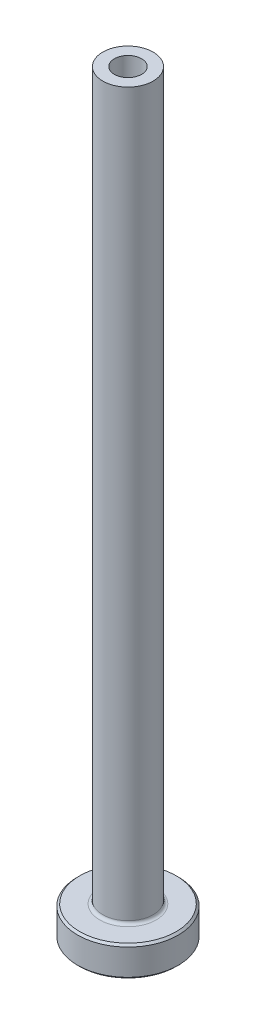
ISO-10303-21;
HEADER;
FILE_DESCRIPTION(('STEP AP214'),'2;1');
FILE_NAME('part.step','',(''),(''),'','','');
FILE_SCHEMA(('AUTOMOTIVE_DESIGN { 1 0 10303 214 1 1 1 1 }'));
ENDSEC;
DATA;
#1=APPLICATION_CONTEXT('core data for automotive mechanical design processes');
#2=APPLICATION_PROTOCOL_DEFINITION('international standard','automotive_design',2000,#1);
#3=PRODUCT_CONTEXT('',#1,'mechanical');
#4=PRODUCT('Part','Part','',(#3));
#5=PRODUCT_RELATED_PRODUCT_CATEGORY('part','',(#4));
#6=PRODUCT_DEFINITION_FORMATION('','',#4);
#7=PRODUCT_DEFINITION_CONTEXT('part definition',#1,'design');
#8=PRODUCT_DEFINITION('design','',#6,#7);
#9=PRODUCT_DEFINITION_SHAPE('','',#8);
#10=(LENGTH_UNIT() NAMED_UNIT(*) SI_UNIT(.MILLI.,.METRE.));
#11=(NAMED_UNIT(*) PLANE_ANGLE_UNIT() SI_UNIT($,.RADIAN.));
#12=(NAMED_UNIT(*) SI_UNIT($,.STERADIAN.) SOLID_ANGLE_UNIT());
#13=UNCERTAINTY_MEASURE_WITH_UNIT(LENGTH_MEASURE(1.E-05),#10,'distance_accuracy_value','');
#14=(GEOMETRIC_REPRESENTATION_CONTEXT(3) GLOBAL_UNCERTAINTY_ASSIGNED_CONTEXT((#13)) GLOBAL_UNIT_ASSIGNED_CONTEXT((#10,
#11,#12)) REPRESENTATION_CONTEXT('',''));
#15=CARTESIAN_POINT('',(0.,0.,0.));
#16=DIRECTION('',(0.,0.,1.));
#17=DIRECTION('',(1.,0.,0.));
#18=AXIS2_PLACEMENT_3D('',#15,#16,#17);
#19=CARTESIAN_POINT('',(0.,92.1876809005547,0.));
#20=DIRECTION('',(0.,1.,0.));
#21=DIRECTION('',(0.,0.,1.));
#22=AXIS2_PLACEMENT_3D('',#19,#20,#21);
#23=CYLINDRICAL_SURFACE('',#22,1.35000000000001);
#24=CARTESIAN_POINT('',(0.,75.,0.));
#25=DIRECTION('',(0.,1.,0.));
#26=DIRECTION('',(0.,0.,1.));
#27=AXIS2_PLACEMENT_3D('',#24,#25,#26);
#28=CIRCLE('',#27,1.35000000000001);
#29=CARTESIAN_POINT('',(0.,75.,1.35000000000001));
#30=VERTEX_POINT('',#29);
#31=EDGE_CURVE('E62',#30,#30,#28,.T.);
#32=ORIENTED_EDGE('',*,*,#31,.T.);
#33=EDGE_LOOP('',(#32));
#34=FACE_BOUND('',#33,.T.);
#35=CARTESIAN_POINT('',(0.,30.,0.));
#36=DIRECTION('',(0.,1.,0.));
#37=DIRECTION('',(0.,0.,1.));
#38=AXIS2_PLACEMENT_3D('',#35,#36,#37);
#39=CIRCLE('',#38,1.35000000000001);
#40=CARTESIAN_POINT('',(0.,30.,1.35000000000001));
#41=VERTEX_POINT('',#40);
#42=EDGE_CURVE('E71',#41,#41,#39,.T.);
#43=ORIENTED_EDGE('',*,*,#42,.F.);
#44=EDGE_LOOP('',(#43));
#45=FACE_BOUND('',#44,.T.);
#46=ADVANCED_FACE('F30',(#34,#45),#23,.F.);
#47=CARTESIAN_POINT('',(-1.35000000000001,75.,0.));
#48=DIRECTION('',(0.,1.,0.));
#49=DIRECTION('',(0.,0.,1.));
#50=AXIS2_PLACEMENT_3D('',#47,#48,#49);
#51=PLANE('',#50);
#52=CARTESIAN_POINT('',(0.,75.,0.));
#53=DIRECTION('',(0.,1.,0.));
#54=DIRECTION('',(0.,0.,1.));
#55=AXIS2_PLACEMENT_3D('',#52,#53,#54);
#56=CIRCLE('',#55,2.5);
#57=CARTESIAN_POINT('',(0.,75.,2.5));
#58=VERTEX_POINT('',#57);
#59=EDGE_CURVE('E65',#58,#58,#56,.T.);
#60=ORIENTED_EDGE('',*,*,#59,.T.);
#61=EDGE_LOOP('',(#60));
#62=FACE_BOUND('',#61,.T.);
#63=ORIENTED_EDGE('',*,*,#31,.F.);
#64=EDGE_LOOP('',(#63));
#65=FACE_BOUND('',#64,.T.);
#66=ADVANCED_FACE('F79',(#62,#65),#51,.T.);
#67=CARTESIAN_POINT('',(0.,92.1876809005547,0.));
#68=DIRECTION('',(0.,1.,0.));
#69=DIRECTION('',(0.,0.,1.));
#70=AXIS2_PLACEMENT_3D('',#67,#68,#69);
#71=CYLINDRICAL_SURFACE('',#70,2.49999999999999);
#72=CARTESIAN_POINT('',(0.,3.3,0.));
#73=DIRECTION('',(0.,1.,0.));
#74=DIRECTION('',(0.,0.,1.));
#75=AXIS2_PLACEMENT_3D('',#72,#73,#74);
#76=CIRCLE('',#75,2.49999999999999);
#77=CARTESIAN_POINT('',(0.,3.3,2.49999999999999));
#78=VERTEX_POINT('',#77);
#79=EDGE_CURVE('E59',#78,#78,#76,.T.);
#80=ORIENTED_EDGE('',*,*,#79,.T.);
#81=EDGE_LOOP('',(#80));
#82=FACE_BOUND('',#81,.T.);
#83=ORIENTED_EDGE('',*,*,#59,.F.);
#84=EDGE_LOOP('',(#83));
#85=FACE_BOUND('',#84,.T.);
#86=ADVANCED_FACE('F85',(#82,#85),#71,.T.);
#87=CARTESIAN_POINT('',(-2.49999999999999,3.,0.));
#88=DIRECTION('',(0.,1.,0.));
#89=DIRECTION('',(0.,0.,1.));
#90=AXIS2_PLACEMENT_3D('',#87,#88,#89);
#91=PLANE('',#90);
#92=CARTESIAN_POINT('',(0.,3.,0.));
#93=DIRECTION('',(0.,1.,0.));
#94=DIRECTION('',(0.,0.,1.));
#95=AXIS2_PLACEMENT_3D('',#92,#93,#94);
#96=CIRCLE('',#95,4.79999999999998);
#97=CARTESIAN_POINT('',(0.,3.,4.79999999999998));
#98=VERTEX_POINT('',#97);
#99=EDGE_CURVE('E53',#98,#98,#96,.T.);
#100=ORIENTED_EDGE('',*,*,#99,.T.);
#101=EDGE_LOOP('',(#100));
#102=FACE_BOUND('',#101,.T.);
#103=CARTESIAN_POINT('',(0.,3.,0.));
#104=DIRECTION('',(0.,1.,0.));
#105=DIRECTION('',(0.,0.,1.));
#106=AXIS2_PLACEMENT_3D('',#103,#104,#105);
#107=CIRCLE('',#106,2.79999999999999);
#108=CARTESIAN_POINT('',(0.,3.,2.79999999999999));
#109=VERTEX_POINT('',#108);
#110=EDGE_CURVE('E56',#109,#109,#107,.F.);
#111=ORIENTED_EDGE('',*,*,#110,.T.);
#112=EDGE_LOOP('',(#111));
#113=FACE_BOUND('',#112,.T.);
#114=ADVANCED_FACE('F111',(#102,#113),#91,.T.);
#115=CARTESIAN_POINT('',(0.,92.1876809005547,0.));
#116=DIRECTION('',(0.,1.,0.));
#117=DIRECTION('',(0.,0.,1.));
#118=AXIS2_PLACEMENT_3D('',#115,#116,#117);
#119=CYLINDRICAL_SURFACE('',#118,4.99999999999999);
#120=CARTESIAN_POINT('',(0.,2.79999999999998,0.));
#121=DIRECTION('',(0.,1.,0.));
#122=DIRECTION('',(0.,0.,1.));
#123=AXIS2_PLACEMENT_3D('',#120,#121,#122);
#124=CIRCLE('',#123,4.99999999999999);
#125=CARTESIAN_POINT('',(0.,2.79999999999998,4.99999999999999));
#126=VERTEX_POINT('',#125);
#127=EDGE_CURVE('E45',#126,#126,#124,.F.);
#128=ORIENTED_EDGE('',*,*,#127,.T.);
#129=EDGE_LOOP('',(#128));
#130=FACE_BOUND('',#129,.T.);
#131=CARTESIAN_POINT('',(0.,0.199999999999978,0.));
#132=DIRECTION('',(0.,-1.,0.));
#133=DIRECTION('',(0.,0.,-1.));
#134=AXIS2_PLACEMENT_3D('',#131,#132,#133);
#135=CIRCLE('',#134,4.99999999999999);
#136=CARTESIAN_POINT('',(0.,0.199999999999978,4.99999999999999));
#137=VERTEX_POINT('',#136);
#138=EDGE_CURVE('E50',#137,#137,#135,.F.);
#139=ORIENTED_EDGE('',*,*,#138,.T.);
#140=EDGE_LOOP('',(#139));
#141=FACE_BOUND('',#140,.T.);
#142=ADVANCED_FACE('F108',(#130,#141),#119,.T.);
#143=CARTESIAN_POINT('',(-4.99999999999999,0.,0.));
#144=DIRECTION('',(0.,-1.,0.));
#145=DIRECTION('',(0.,0.,-1.));
#146=AXIS2_PLACEMENT_3D('',#143,#144,#145);
#147=PLANE('',#146);
#148=CARTESIAN_POINT('',(0.,0.,0.));
#149=DIRECTION('',(0.,-1.,0.));
#150=DIRECTION('',(0.,0.,-1.));
#151=AXIS2_PLACEMENT_3D('',#148,#149,#150);
#152=CIRCLE('',#151,2.09999999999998);
#153=CARTESIAN_POINT('',(0.,0.,-2.09999999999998));
#154=VERTEX_POINT('',#153);
#155=EDGE_CURVE('E37',#154,#154,#152,.F.);
#156=ORIENTED_EDGE('',*,*,#155,.T.);
#157=EDGE_LOOP('',(#156));
#158=FACE_BOUND('',#157,.T.);
#159=CARTESIAN_POINT('',(0.,0.,0.));
#160=DIRECTION('',(0.,-1.,0.));
#161=DIRECTION('',(0.,0.,-1.));
#162=AXIS2_PLACEMENT_3D('',#159,#160,#161);
#163=CIRCLE('',#162,4.80000000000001);
#164=CARTESIAN_POINT('',(0.,0.,4.80000000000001));
#165=VERTEX_POINT('',#164);
#166=EDGE_CURVE('E41',#165,#165,#163,.T.);
#167=ORIENTED_EDGE('',*,*,#166,.T.);
#168=EDGE_LOOP('',(#167));
#169=FACE_BOUND('',#168,.T.);
#170=ADVANCED_FACE('F110',(#158,#169),#147,.T.);
#171=CARTESIAN_POINT('',(0.,92.1876809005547,0.));
#172=DIRECTION('',(0.,1.,0.));
#173=DIRECTION('',(0.,0.,1.));
#174=AXIS2_PLACEMENT_3D('',#171,#172,#173);
#175=CYLINDRICAL_SURFACE('',#174,1.59999999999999);
#176=CARTESIAN_POINT('',(0.,0.5,0.));
#177=DIRECTION('',(0.,-1.,0.));
#178=DIRECTION('',(0.,0.,-1.));
#179=AXIS2_PLACEMENT_3D('',#176,#177,#178);
#180=CIRCLE('',#179,1.59999999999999);
#181=CARTESIAN_POINT('',(0.,0.5,-1.59999999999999));
#182=VERTEX_POINT('',#181);
#183=EDGE_CURVE('E10',#182,#182,#180,.T.);
#184=ORIENTED_EDGE('',*,*,#183,.T.);
#185=EDGE_LOOP('',(#184));
#186=FACE_BOUND('',#185,.T.);
#187=CARTESIAN_POINT('',(0.,18.,0.));
#188=DIRECTION('',(0.,1.,0.));
#189=DIRECTION('',(0.,0.,1.));
#190=AXIS2_PLACEMENT_3D('',#187,#188,#189);
#191=CIRCLE('',#190,1.59999999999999);
#192=CARTESIAN_POINT('',(0.,18.,1.59999999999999));
#193=VERTEX_POINT('',#192);
#194=EDGE_CURVE('E68',#193,#193,#191,.T.);
#195=ORIENTED_EDGE('',*,*,#194,.T.);
#196=EDGE_LOOP('',(#195));
#197=FACE_BOUND('',#196,.T.);
#198=ADVANCED_FACE('F118',(#186,#197),#175,.F.);
#199=CARTESIAN_POINT('',(0.,18.,0.));
#200=DIRECTION('',(0.,-1.,0.));
#201=DIRECTION('',(0.,0.,-1.));
#202=AXIS2_PLACEMENT_3D('',#199,#200,#201);
#203=CONICAL_SURFACE('',#202,1.59999999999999,0.0208303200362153);
#204=ORIENTED_EDGE('',*,*,#42,.T.);
#205=EDGE_LOOP('',(#204));
#206=FACE_BOUND('',#205,.T.);
#207=ORIENTED_EDGE('',*,*,#194,.F.);
#208=EDGE_LOOP('',(#207));
#209=FACE_BOUND('',#208,.T.);
#210=ADVANCED_FACE('F75',(#206,#209),#203,.F.);
#211=CARTESIAN_POINT('',(0.,3.3,0.));
#212=DIRECTION('',(0.,1.,0.));
#213=DIRECTION('',(0.,0.,1.));
#214=AXIS2_PLACEMENT_3D('',#211,#212,#213);
#215=TOROIDAL_SURFACE('',#214,2.79999999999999,0.3);
#216=ORIENTED_EDGE('',*,*,#110,.F.);
#217=EDGE_LOOP('',(#216));
#218=FACE_BOUND('',#217,.T.);
#219=ORIENTED_EDGE('',*,*,#79,.F.);
#220=EDGE_LOOP('',(#219));
#221=FACE_BOUND('',#220,.T.);
#222=ADVANCED_FACE('F90',(#218,#221),#215,.F.);
#223=CARTESIAN_POINT('',(0.,3.,0.));
#224=DIRECTION('',(0.,-1.,0.));
#225=DIRECTION('',(0.,0.,-1.));
#226=AXIS2_PLACEMENT_3D('',#223,#224,#225);
#227=CONICAL_SURFACE('',#226,4.79999999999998,0.785398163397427);
#228=ORIENTED_EDGE('',*,*,#127,.F.);
#229=EDGE_LOOP('',(#228));
#230=FACE_BOUND('',#229,.T.);
#231=ORIENTED_EDGE('',*,*,#99,.F.);
#232=EDGE_LOOP('',(#231));
#233=FACE_BOUND('',#232,.T.);
#234=ADVANCED_FACE('F93',(#230,#233),#227,.T.);
#235=CARTESIAN_POINT('',(0.,0.199999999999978,0.));
#236=DIRECTION('',(0.,1.,0.));
#237=DIRECTION('',(0.,0.,1.));
#238=AXIS2_PLACEMENT_3D('',#235,#236,#237);
#239=CONICAL_SURFACE('',#238,4.99999999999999,0.785398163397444);
#240=CARTESIAN_POINT('',(0.,0.,4.80000000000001));
#241=CARTESIAN_POINT('',(0.,0.00208333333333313,4.80208333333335));
#242=CARTESIAN_POINT('',(0.,0.00416666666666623,4.80416666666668));
#243=CARTESIAN_POINT('',(0.,0.00833333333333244,4.80833333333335));
#244=CARTESIAN_POINT('',(0.,0.0104166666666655,4.81041666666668));
#245=CARTESIAN_POINT('',(0.,0.0145833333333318,4.81458333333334));
#246=CARTESIAN_POINT('',(0.,0.0166666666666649,4.81666666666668));
#247=CARTESIAN_POINT('',(0.,0.0208333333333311,4.82083333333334));
#248=CARTESIAN_POINT('',(0.,0.0229166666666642,4.82291666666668));
#249=CARTESIAN_POINT('',(0.,0.0270833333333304,4.82708333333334));
#250=CARTESIAN_POINT('',(0.,0.0291666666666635,4.82916666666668));
#251=CARTESIAN_POINT('',(0.,0.0333333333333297,4.83333333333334));
#252=CARTESIAN_POINT('',(0.,0.0354166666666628,4.83541666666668));
#253=CARTESIAN_POINT('',(0.,0.039583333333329,4.83958333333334));
#254=CARTESIAN_POINT('',(0.,0.0416666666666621,4.84166666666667));
#255=CARTESIAN_POINT('',(0.,0.0458333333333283,4.84583333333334));
#256=CARTESIAN_POINT('',(0.,0.0479166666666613,4.84791666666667));
#257=CARTESIAN_POINT('',(0.,0.0520833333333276,4.85208333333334));
#258=CARTESIAN_POINT('',(0.,0.0541666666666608,4.85416666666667));
#259=CARTESIAN_POINT('',(0.,0.058333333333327,4.85833333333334));
#260=CARTESIAN_POINT('',(0.,0.0604166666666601,4.86041666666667));
#261=CARTESIAN_POINT('',(0.,0.0645833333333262,4.86458333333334));
#262=CARTESIAN_POINT('',(0.,0.0666666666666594,4.86666666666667));
#263=CARTESIAN_POINT('',(0.,0.0708333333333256,4.87083333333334));
#264=CARTESIAN_POINT('',(0.,0.0729166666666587,4.87291666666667));
#265=CARTESIAN_POINT('',(0.,0.0770833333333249,4.87708333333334));
#266=CARTESIAN_POINT('',(0.,0.079166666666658,4.87916666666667));
#267=CARTESIAN_POINT('',(0.,0.0833333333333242,4.88333333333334));
#268=CARTESIAN_POINT('',(0.,0.0854166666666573,4.88541666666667));
#269=CARTESIAN_POINT('',(0.,0.0895833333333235,4.88958333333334));
#270=CARTESIAN_POINT('',(0.,0.0916666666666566,4.89166666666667));
#271=CARTESIAN_POINT('',(0.,0.0958333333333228,4.89583333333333));
#272=CARTESIAN_POINT('',(0.,0.0979166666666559,4.89791666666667));
#273=CARTESIAN_POINT('',(0.,0.102083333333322,4.90208333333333));
#274=CARTESIAN_POINT('',(0.,0.104166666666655,4.90416666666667));
#275=CARTESIAN_POINT('',(0.,0.108333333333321,4.90833333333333));
#276=CARTESIAN_POINT('',(0.,0.110416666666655,4.91041666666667));
#277=CARTESIAN_POINT('',(0.,0.114583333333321,4.91458333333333));
#278=CARTESIAN_POINT('',(0.,0.116666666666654,4.91666666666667));
#279=CARTESIAN_POINT('',(0.,0.12083333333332,4.92083333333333));
#280=CARTESIAN_POINT('',(0.,0.122916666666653,4.92291666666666));
#281=CARTESIAN_POINT('',(0.,0.127083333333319,4.92708333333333));
#282=CARTESIAN_POINT('',(0.,0.129166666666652,4.92916666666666));
#283=CARTESIAN_POINT('',(0.,0.133333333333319,4.93333333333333));
#284=CARTESIAN_POINT('',(0.,0.135416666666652,4.93541666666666));
#285=CARTESIAN_POINT('',(0.,0.139583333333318,4.93958333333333));
#286=CARTESIAN_POINT('',(0.,0.141666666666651,4.94166666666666));
#287=CARTESIAN_POINT('',(0.,0.145833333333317,4.94583333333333));
#288=CARTESIAN_POINT('',(0.,0.14791666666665,4.94791666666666));
#289=CARTESIAN_POINT('',(0.,0.152083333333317,4.95208333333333));
#290=CARTESIAN_POINT('',(0.,0.15416666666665,4.95416666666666));
#291=CARTESIAN_POINT('',(0.,0.158333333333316,4.95833333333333));
#292=CARTESIAN_POINT('',(0.,0.160416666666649,4.96041666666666));
#293=CARTESIAN_POINT('',(0.,0.164583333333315,4.96458333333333));
#294=CARTESIAN_POINT('',(0.,0.166666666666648,4.96666666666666));
#295=CARTESIAN_POINT('',(0.,0.170833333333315,4.97083333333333));
#296=CARTESIAN_POINT('',(0.,0.172916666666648,4.97291666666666));
#297=CARTESIAN_POINT('',(0.,0.177083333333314,4.97708333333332));
#298=CARTESIAN_POINT('',(0.,0.179166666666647,4.97916666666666));
#299=CARTESIAN_POINT('',(0.,0.183333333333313,4.98333333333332));
#300=CARTESIAN_POINT('',(0.,0.185416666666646,4.98541666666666));
#301=CARTESIAN_POINT('',(0.,0.189583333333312,4.98958333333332));
#302=CARTESIAN_POINT('',(0.,0.191666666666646,4.99166666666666));
#303=CARTESIAN_POINT('',(0.,0.195833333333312,4.99583333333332));
#304=CARTESIAN_POINT('',(0.,0.197916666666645,4.99791666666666));
#305=CARTESIAN_POINT('',(0.,0.199999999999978,4.99999999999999));
#306=B_SPLINE_CURVE_WITH_KNOTS('',3,(#240,#241,#242,#243,#244,#245,#246,#247,#248,#249,#250,
#251,#252,#253,#254,#255,#256,#257,#258,#259,#260,#261,#262,#263,#264,#265,#266,#267,#268,#269,
#270,#271,#272,#273,#274,#275,#276,#277,#278,#279,#280,#281,#282,#283,#284,#285,#286,#287,#288,
#289,#290,#291,#292,#293,#294,#295,#296,#297,#298,#299,#300,#301,#302,#303,#304,#305),
.UNSPECIFIED.,.F.,.F.,(4,2,2,2,2,2,2,2,2,2,2,2,2,2,2,2,2,2,2,2,2,2,2,2,2,2,2,2,2,2,2,2,4),(0.,
0.00883883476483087,0.0176776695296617,0.0265165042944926,0.0353553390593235,0.0441941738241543,
0.0530330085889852,0.0618718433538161,0.070710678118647,0.0795495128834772,0.0883883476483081,
0.0972271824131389,0.10606601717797,0.114904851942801,0.123743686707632,0.132582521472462,
0.141421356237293,0.150260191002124,0.159099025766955,0.167937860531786,0.176776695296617,
0.185615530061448,0.194454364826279,0.203293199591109,0.21213203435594,0.220970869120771,
0.229809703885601,0.238648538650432,0.247487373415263,0.256326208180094,0.265165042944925,
0.274003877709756,0.282842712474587),.UNSPECIFIED.);
#307=EDGE_CURVE('BSEAM96',#165,#137,#306,.T.);
#308=ORIENTED_EDGE('',*,*,#166,.F.);
#309=ORIENTED_EDGE('',*,*,#138,.F.);
#310=ORIENTED_EDGE('',*,*,#307,.T.);
#311=ORIENTED_EDGE('',*,*,#307,.F.);
#312=EDGE_LOOP('',(#308,#310,#309,#311));
#313=FACE_BOUND('',#312,.T.);
#314=ADVANCED_FACE('F96',(#313),#239,.T.);
#315=CARTESIAN_POINT('',(0.,0.,0.));
#316=DIRECTION('',(0.,-1.,0.));
#317=DIRECTION('',(0.,0.,-1.));
#318=AXIS2_PLACEMENT_3D('',#315,#316,#317);
#319=CONICAL_SURFACE('',#318,2.09999999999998,0.785398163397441);
#320=ORIENTED_EDGE('',*,*,#183,.F.);
#321=EDGE_LOOP('',(#320));
#322=FACE_BOUND('',#321,.T.);
#323=ORIENTED_EDGE('',*,*,#155,.F.);
#324=EDGE_LOOP('',(#323));
#325=FACE_BOUND('',#324,.T.);
#326=ADVANCED_FACE('F32',(#322,#325),#319,.F.);
#327=CLOSED_SHELL('',(#46,#66,#86,#114,#142,#170,#198,#210,#222,#234,#314,#326));
#328=MANIFOLD_SOLID_BREP('B2',#327);
#329=ADVANCED_BREP_SHAPE_REPRESENTATION('',(#18,#328),#14);
#330=SHAPE_DEFINITION_REPRESENTATION(#9,#329);
ENDSEC;
END-ISO-10303-21;
